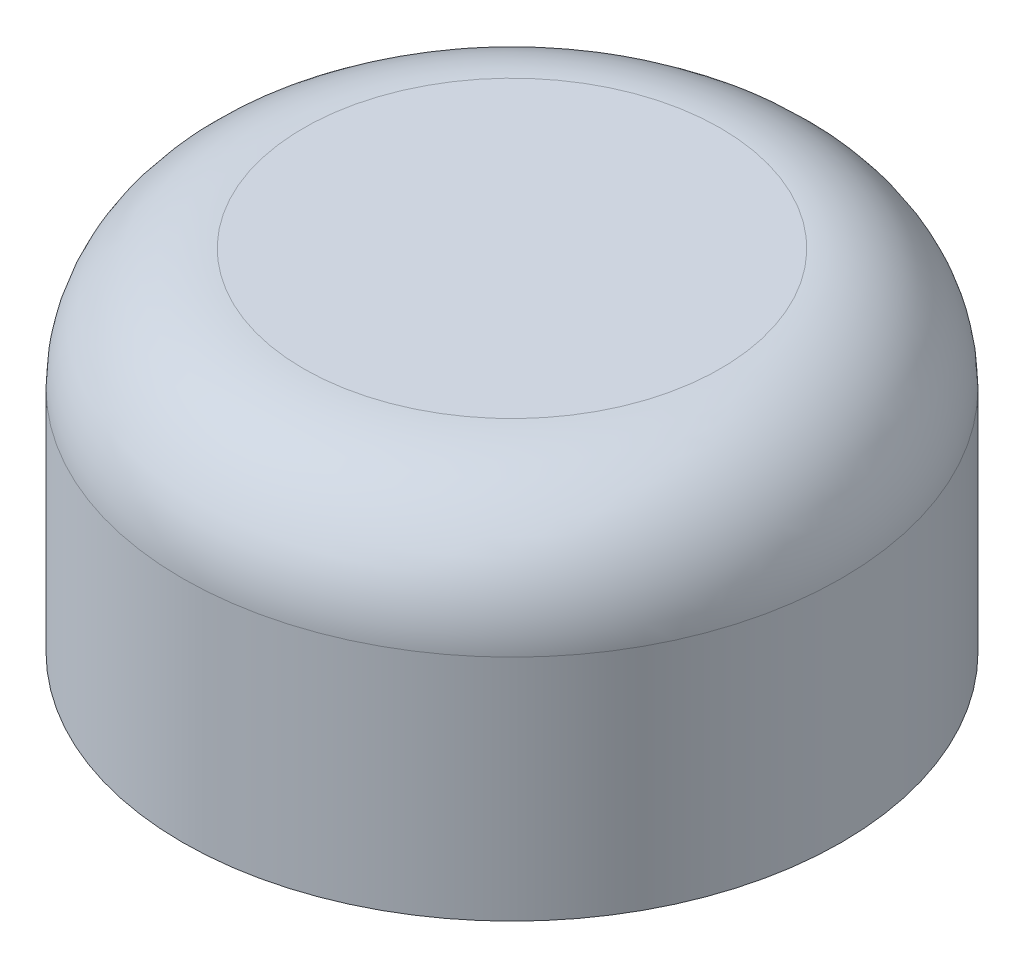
ISO-10303-21;
HEADER;
FILE_DESCRIPTION(('STEP AP214'),'2;1');
FILE_NAME('part.step','',(''),(''),'','','');
FILE_SCHEMA(('AUTOMOTIVE_DESIGN { 1 0 10303 214 1 1 1 1 }'));
ENDSEC;
DATA;
#1=APPLICATION_CONTEXT('core data for automotive mechanical design processes');
#2=APPLICATION_PROTOCOL_DEFINITION('international standard','automotive_design',2000,#1);
#3=PRODUCT_CONTEXT('',#1,'mechanical');
#4=PRODUCT('Part','Part','',(#3));
#5=PRODUCT_RELATED_PRODUCT_CATEGORY('part','',(#4));
#6=PRODUCT_DEFINITION_FORMATION('','',#4);
#7=PRODUCT_DEFINITION_CONTEXT('part definition',#1,'design');
#8=PRODUCT_DEFINITION('design','',#6,#7);
#9=PRODUCT_DEFINITION_SHAPE('','',#8);
#10=(LENGTH_UNIT() NAMED_UNIT(*) SI_UNIT(.MILLI.,.METRE.));
#11=(NAMED_UNIT(*) PLANE_ANGLE_UNIT() SI_UNIT($,.RADIAN.));
#12=(NAMED_UNIT(*) SI_UNIT($,.STERADIAN.) SOLID_ANGLE_UNIT());
#13=UNCERTAINTY_MEASURE_WITH_UNIT(LENGTH_MEASURE(1.E-05),#10,'distance_accuracy_value','');
#14=(GEOMETRIC_REPRESENTATION_CONTEXT(3) GLOBAL_UNCERTAINTY_ASSIGNED_CONTEXT((#13)) GLOBAL_UNIT_ASSIGNED_CONTEXT((#10,
#11,#12)) REPRESENTATION_CONTEXT('',''));
#15=CARTESIAN_POINT('',(0.,0.,0.));
#16=DIRECTION('',(0.,0.,1.));
#17=DIRECTION('',(1.,0.,0.));
#18=AXIS2_PLACEMENT_3D('',#15,#16,#17);
#19=CARTESIAN_POINT('',(0.,22.6982613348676,0.));
#20=DIRECTION('',(0.,-1.,0.));
#21=DIRECTION('',(0.,0.,-1.));
#22=AXIS2_PLACEMENT_3D('',#19,#20,#21);
#23=PLANE('',#22);
#24=CARTESIAN_POINT('',(0.,22.6982613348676,0.));
#25=DIRECTION('',(0.,-1.,0.));
#26=DIRECTION('',(0.,0.,-1.));
#27=AXIS2_PLACEMENT_3D('',#24,#25,#26);
#28=CIRCLE('',#27,7.874);
#29=CARTESIAN_POINT('',(0.,22.6982613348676,-7.874));
#30=VERTEX_POINT('',#29);
#31=EDGE_CURVE('E10',#30,#30,#28,.F.);
#32=ORIENTED_EDGE('',*,*,#31,.T.);
#33=EDGE_LOOP('',(#32));
#34=FACE_BOUND('',#33,.T.);
#35=ADVANCED_FACE('F26',(#34),#23,.F.);
#36=CARTESIAN_POINT('',(0.,0.,0.));
#37=DIRECTION('',(0.,-1.,0.));
#38=DIRECTION('',(0.,0.,-1.));
#39=AXIS2_PLACEMENT_3D('',#36,#37,#38);
#40=CYLINDRICAL_SURFACE('',#39,12.446);
#41=CARTESIAN_POINT('',(0.,18.1262613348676,0.));
#42=DIRECTION('',(0.,-1.,0.));
#43=DIRECTION('',(0.,0.,-1.));
#44=AXIS2_PLACEMENT_3D('',#41,#42,#43);
#45=CIRCLE('',#44,12.446);
#46=CARTESIAN_POINT('',(0.,18.1262613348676,-12.446));
#47=VERTEX_POINT('',#46);
#48=EDGE_CURVE('E32',#47,#47,#45,.T.);
#49=ORIENTED_EDGE('',*,*,#48,.T.);
#50=EDGE_LOOP('',(#49));
#51=FACE_BOUND('',#50,.T.);
#52=CARTESIAN_POINT('',(0.,9.49026133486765,0.));
#53=DIRECTION('',(0.,-1.,0.));
#54=DIRECTION('',(0.,0.,-1.));
#55=AXIS2_PLACEMENT_3D('',#52,#53,#54);
#56=CIRCLE('',#55,12.446);
#57=CARTESIAN_POINT('',(0.,9.49026133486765,-12.446));
#58=VERTEX_POINT('',#57);
#59=EDGE_CURVE('E45',#58,#58,#56,.T.);
#60=ORIENTED_EDGE('',*,*,#59,.F.);
#61=EDGE_LOOP('',(#60));
#62=FACE_BOUND('',#61,.T.);
#63=ADVANCED_FACE('F75',(#51,#62),#40,.T.);
#64=CARTESIAN_POINT('',(12.446,9.49026133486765,0.));
#65=DIRECTION('',(0.,1.,0.));
#66=DIRECTION('',(0.,0.,1.));
#67=AXIS2_PLACEMENT_3D('',#64,#65,#66);
#68=PLANE('',#67);
#69=CARTESIAN_POINT('',(0.,9.49026133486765,0.));
#70=DIRECTION('',(0.,-1.,0.));
#71=DIRECTION('',(0.,0.,-1.));
#72=AXIS2_PLACEMENT_3D('',#69,#70,#71);
#73=CIRCLE('',#72,10.16);
#74=CARTESIAN_POINT('',(0.,9.49026133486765,-10.16));
#75=VERTEX_POINT('',#74);
#76=EDGE_CURVE('E48',#75,#75,#73,.T.);
#77=ORIENTED_EDGE('',*,*,#76,.F.);
#78=EDGE_LOOP('',(#77));
#79=FACE_BOUND('',#78,.T.);
#80=ORIENTED_EDGE('',*,*,#59,.T.);
#81=EDGE_LOOP('',(#80));
#82=FACE_BOUND('',#81,.T.);
#83=ADVANCED_FACE('F69',(#79,#82),#68,.F.);
#84=CARTESIAN_POINT('',(0.,0.,0.));
#85=DIRECTION('',(0.,-1.,0.));
#86=DIRECTION('',(0.,0.,-1.));
#87=AXIS2_PLACEMENT_3D('',#84,#85,#86);
#88=CYLINDRICAL_SURFACE('',#87,10.16);
#89=CARTESIAN_POINT('',(0.,10.7602613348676,0.));
#90=DIRECTION('',(0.,-1.,0.));
#91=DIRECTION('',(0.,0.,-1.));
#92=AXIS2_PLACEMENT_3D('',#89,#90,#91);
#93=CIRCLE('',#92,10.16);
#94=CARTESIAN_POINT('',(0.,10.7602613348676,-10.16));
#95=VERTEX_POINT('',#94);
#96=EDGE_CURVE('E51',#95,#95,#93,.T.);
#97=ORIENTED_EDGE('',*,*,#96,.F.);
#98=EDGE_LOOP('',(#97));
#99=FACE_BOUND('',#98,.T.);
#100=ORIENTED_EDGE('',*,*,#76,.T.);
#101=EDGE_LOOP('',(#100));
#102=FACE_BOUND('',#101,.T.);
#103=ADVANCED_FACE('F63',(#99,#102),#88,.F.);
#104=CARTESIAN_POINT('',(10.16,10.7602613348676,0.));
#105=DIRECTION('',(0.,-1.,0.));
#106=DIRECTION('',(0.,0.,-1.));
#107=AXIS2_PLACEMENT_3D('',#104,#105,#106);
#108=PLANE('',#107);
#109=CARTESIAN_POINT('',(0.,10.7602613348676,0.));
#110=DIRECTION('',(0.,-1.,0.));
#111=DIRECTION('',(0.,0.,-1.));
#112=AXIS2_PLACEMENT_3D('',#109,#110,#111);
#113=CIRCLE('',#112,11.684);
#114=CARTESIAN_POINT('',(0.,10.7602613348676,-11.684));
#115=VERTEX_POINT('',#114);
#116=EDGE_CURVE('E54',#115,#115,#113,.T.);
#117=ORIENTED_EDGE('',*,*,#116,.F.);
#118=EDGE_LOOP('',(#117));
#119=FACE_BOUND('',#118,.T.);
#120=ORIENTED_EDGE('',*,*,#96,.T.);
#121=EDGE_LOOP('',(#120));
#122=FACE_BOUND('',#121,.T.);
#123=ADVANCED_FACE('F60',(#119,#122),#108,.F.);
#124=CARTESIAN_POINT('',(0.,0.,0.));
#125=DIRECTION('',(0.,-1.,0.));
#126=DIRECTION('',(0.,0.,-1.));
#127=AXIS2_PLACEMENT_3D('',#124,#125,#126);
#128=CYLINDRICAL_SURFACE('',#127,11.684);
#129=CARTESIAN_POINT('',(0.,17.6182613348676,0.));
#130=DIRECTION('',(0.,1.,0.));
#131=DIRECTION('',(0.,0.,1.));
#132=AXIS2_PLACEMENT_3D('',#129,#130,#131);
#133=CIRCLE('',#132,11.684);
#134=CARTESIAN_POINT('',(0.,17.6182613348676,11.684));
#135=VERTEX_POINT('',#134);
#136=EDGE_CURVE('E36',#135,#135,#133,.T.);
#137=ORIENTED_EDGE('',*,*,#136,.T.);
#138=EDGE_LOOP('',(#137));
#139=FACE_BOUND('',#138,.T.);
#140=ORIENTED_EDGE('',*,*,#116,.T.);
#141=EDGE_LOOP('',(#140));
#142=FACE_BOUND('',#141,.T.);
#143=ADVANCED_FACE('F58',(#139,#142),#128,.F.);
#144=CARTESIAN_POINT('',(11.684,21.4282613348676,0.));
#145=DIRECTION('',(0.,1.,0.));
#146=DIRECTION('',(0.,0.,1.));
#147=AXIS2_PLACEMENT_3D('',#144,#145,#146);
#148=PLANE('',#147);
#149=CARTESIAN_POINT('',(0.,21.4282613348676,0.));
#150=DIRECTION('',(0.,1.,0.));
#151=DIRECTION('',(0.,0.,1.));
#152=AXIS2_PLACEMENT_3D('',#149,#150,#151);
#153=CIRCLE('',#152,7.874);
#154=CARTESIAN_POINT('',(0.,21.4282613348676,7.874));
#155=VERTEX_POINT('',#154);
#156=EDGE_CURVE('E40',#155,#155,#153,.F.);
#157=ORIENTED_EDGE('',*,*,#156,.T.);
#158=EDGE_LOOP('',(#157));
#159=FACE_BOUND('',#158,.T.);
#160=ADVANCED_FACE('F87',(#159),#148,.F.);
#161=CARTESIAN_POINT('',(0.,17.6182613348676,0.));
#162=DIRECTION('',(0.,1.,0.));
#163=DIRECTION('',(0.,0.,1.));
#164=AXIS2_PLACEMENT_3D('',#161,#162,#163);
#165=TOROIDAL_SURFACE('',#164,7.874,3.81);
#166=ORIENTED_EDGE('',*,*,#136,.F.);
#167=EDGE_LOOP('',(#166));
#168=FACE_BOUND('',#167,.T.);
#169=ORIENTED_EDGE('',*,*,#156,.F.);
#170=EDGE_LOOP('',(#169));
#171=FACE_BOUND('',#170,.T.);
#172=ADVANCED_FACE('F91',(#168,#171),#165,.F.);
#173=CARTESIAN_POINT('',(0.,18.1262613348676,0.));
#174=DIRECTION('',(0.,-1.,0.));
#175=DIRECTION('',(0.,0.,-1.));
#176=AXIS2_PLACEMENT_3D('',#173,#174,#175);
#177=TOROIDAL_SURFACE('',#176,7.874,4.572);
#178=ORIENTED_EDGE('',*,*,#31,.F.);
#179=EDGE_LOOP('',(#178));
#180=FACE_BOUND('',#179,.T.);
#181=ORIENTED_EDGE('',*,*,#48,.F.);
#182=EDGE_LOOP('',(#181));
#183=FACE_BOUND('',#182,.T.);
#184=ADVANCED_FACE('F95',(#180,#183),#177,.T.);
#185=CLOSED_SHELL('',(#35,#63,#83,#103,#123,#143,#160,#172,#184));
#186=MANIFOLD_SOLID_BREP('B2',#185);
#187=ADVANCED_BREP_SHAPE_REPRESENTATION('',(#18,#186),#14);
#188=SHAPE_DEFINITION_REPRESENTATION(#9,#187);
ENDSEC;
END-ISO-10303-21;
